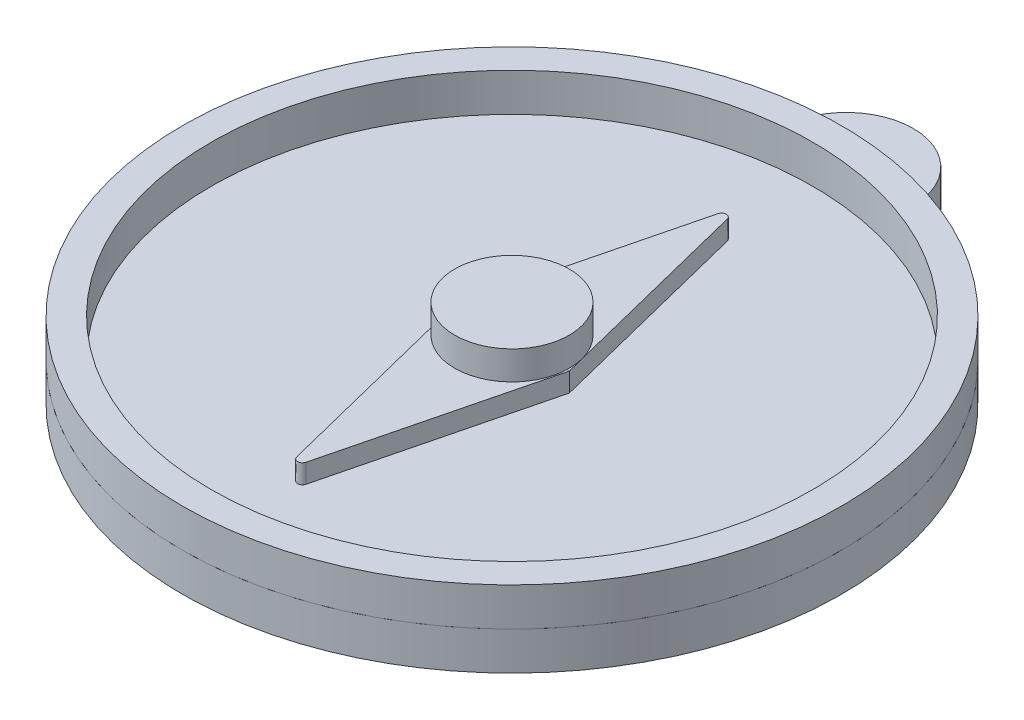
ISO-10303-21;
HEADER;
FILE_DESCRIPTION(('STEP AP214'),'2;1');
FILE_NAME('part.step','',(''),(''),'','','');
FILE_SCHEMA(('AUTOMOTIVE_DESIGN { 1 0 10303 214 1 1 1 1 }'));
ENDSEC;
DATA;
#1=APPLICATION_CONTEXT('core data for automotive mechanical design processes');
#2=APPLICATION_PROTOCOL_DEFINITION('international standard','automotive_design',2000,#1);
#3=PRODUCT_CONTEXT('',#1,'mechanical');
#4=PRODUCT('Part','Part','',(#3));
#5=PRODUCT_RELATED_PRODUCT_CATEGORY('part','',(#4));
#6=PRODUCT_DEFINITION_FORMATION('','',#4);
#7=PRODUCT_DEFINITION_CONTEXT('part definition',#1,'design');
#8=PRODUCT_DEFINITION('design','',#6,#7);
#9=PRODUCT_DEFINITION_SHAPE('','',#8);
#10=(LENGTH_UNIT() NAMED_UNIT(*) SI_UNIT(.MILLI.,.METRE.));
#11=(NAMED_UNIT(*) PLANE_ANGLE_UNIT() SI_UNIT($,.RADIAN.));
#12=(NAMED_UNIT(*) SI_UNIT($,.STERADIAN.) SOLID_ANGLE_UNIT());
#13=UNCERTAINTY_MEASURE_WITH_UNIT(LENGTH_MEASURE(1.E-05),#10,'distance_accuracy_value','');
#14=(GEOMETRIC_REPRESENTATION_CONTEXT(3) GLOBAL_UNCERTAINTY_ASSIGNED_CONTEXT((#13)) GLOBAL_UNIT_ASSIGNED_CONTEXT((#10,
#11,#12)) REPRESENTATION_CONTEXT('',''));
#15=CARTESIAN_POINT('',(0.,0.,0.));
#16=DIRECTION('',(0.,0.,1.));
#17=DIRECTION('',(1.,0.,0.));
#18=AXIS2_PLACEMENT_3D('',#15,#16,#17);
#19=CARTESIAN_POINT('',(0.,4.,-35.));
#20=DIRECTION('',(0.,-1.,0.));
#21=DIRECTION('',(0.,0.,-1.));
#22=AXIS2_PLACEMENT_3D('',#19,#20,#21);
#23=CYLINDRICAL_SURFACE('',#22,7.);
#24=CARTESIAN_POINT('',(0.,0.,-35.));
#25=DIRECTION('',(0.,1.,0.));
#26=DIRECTION('',(0.,0.,1.));
#27=AXIS2_PLACEMENT_3D('',#24,#25,#26);
#28=CIRCLE('',#27,7.);
#29=CARTESIAN_POINT('',(6.89699635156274,0.,-33.8035714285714));
#30=VERTEX_POINT('',#29);
#31=CARTESIAN_POINT('',(-6.8969963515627,0.,-33.8035714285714));
#32=VERTEX_POINT('',#31);
#33=EDGE_CURVE('E79',#30,#32,#28,.T.);
#34=ORIENTED_EDGE('',*,*,#33,.T.);
#35=DIRECTION('',(0.,-1.,0.));
#36=VECTOR('',#35,1.);
#37=CARTESIAN_POINT('',(-6.8969963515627,4.,-33.8035714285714));
#38=LINE('',#37,#36);
#39=CARTESIAN_POINT('',(-6.8969963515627,4.,-33.8035714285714));
#40=VERTEX_POINT('',#39);
#41=EDGE_CURVE('E12',#40,#32,#38,.T.);
#42=ORIENTED_EDGE('',*,*,#41,.F.);
#43=CARTESIAN_POINT('',(0.,4.,-35.));
#44=DIRECTION('',(0.,1.,0.));
#45=DIRECTION('',(0.,0.,1.));
#46=AXIS2_PLACEMENT_3D('',#43,#44,#45);
#47=CIRCLE('',#46,7.);
#48=CARTESIAN_POINT('',(6.89699635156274,4.,-33.8035714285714));
#49=VERTEX_POINT('',#48);
#50=EDGE_CURVE('E78',#49,#40,#47,.T.);
#51=ORIENTED_EDGE('',*,*,#50,.F.);
#52=DIRECTION('',(0.,-1.,0.));
#53=VECTOR('',#52,1.);
#54=CARTESIAN_POINT('',(6.89699635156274,4.,-33.8035714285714));
#55=LINE('',#54,#53);
#56=EDGE_CURVE('E56',#49,#30,#55,.T.);
#57=ORIENTED_EDGE('',*,*,#56,.T.);
#58=EDGE_LOOP('',(#34,#42,#51,#57));
#59=FACE_BOUND('',#58,.T.);
#60=ADVANCED_FACE('F48',(#59),#23,.T.);
#61=CARTESIAN_POINT('',(0.,4.,0.));
#62=DIRECTION('',(0.,-1.,0.));
#63=DIRECTION('',(0.,0.,-1.));
#64=AXIS2_PLACEMENT_3D('',#61,#62,#63);
#65=CYLINDRICAL_SURFACE('',#64,34.5);
#66=CARTESIAN_POINT('',(0.,0.,0.));
#67=DIRECTION('',(0.,1.,0.));
#68=DIRECTION('',(0.,0.,1.));
#69=AXIS2_PLACEMENT_3D('',#66,#67,#68);
#70=CIRCLE('',#69,34.5);
#71=EDGE_CURVE('E71',#32,#30,#70,.T.);
#72=ORIENTED_EDGE('',*,*,#71,.T.);
#73=ORIENTED_EDGE('',*,*,#56,.F.);
#74=CARTESIAN_POINT('',(0.,4.,0.));
#75=DIRECTION('',(0.,1.,0.));
#76=DIRECTION('',(0.,0.,1.));
#77=AXIS2_PLACEMENT_3D('',#74,#75,#76);
#78=CIRCLE('',#77,34.5);
#79=EDGE_CURVE('E63',#40,#49,#78,.T.);
#80=ORIENTED_EDGE('',*,*,#79,.F.);
#81=ORIENTED_EDGE('',*,*,#41,.T.);
#82=EDGE_LOOP('',(#72,#73,#80,#81));
#83=FACE_BOUND('',#82,.T.);
#84=ADVANCED_FACE('F74',(#83),#65,.T.);
#85=CARTESIAN_POINT('',(0.,4.,-17.5));
#86=DIRECTION('',(0.,1.,0.));
#87=DIRECTION('',(0.,0.,1.));
#88=AXIS2_PLACEMENT_3D('',#85,#86,#87);
#89=PLANE('',#88);
#90=CARTESIAN_POINT('',(0.,4.,0.));
#91=DIRECTION('',(0.,1.,0.));
#92=DIRECTION('',(0.,0.,1.));
#93=AXIS2_PLACEMENT_3D('',#90,#91,#92);
#94=CIRCLE('',#93,1.625);
#95=CARTESIAN_POINT('',(0.,4.,1.625));
#96=VERTEX_POINT('',#95);
#97=EDGE_CURVE('E86',#96,#96,#94,.T.);
#98=ORIENTED_EDGE('',*,*,#97,.F.);
#99=EDGE_LOOP('',(#98));
#100=FACE_BOUND('',#99,.T.);
#101=ORIENTED_EDGE('',*,*,#50,.T.);
#102=ORIENTED_EDGE('',*,*,#79,.T.);
#103=EDGE_LOOP('',(#101,#102));
#104=FACE_BOUND('',#103,.T.);
#105=ADVANCED_FACE('F121',(#100,#104),#89,.T.);
#106=CARTESIAN_POINT('',(0.,0.,-17.5));
#107=DIRECTION('',(0.,1.,0.));
#108=DIRECTION('',(0.,0.,1.));
#109=AXIS2_PLACEMENT_3D('',#106,#107,#108);
#110=PLANE('',#109);
#111=ORIENTED_EDGE('',*,*,#33,.F.);
#112=ORIENTED_EDGE('',*,*,#71,.F.);
#113=EDGE_LOOP('',(#111,#112));
#114=FACE_BOUND('',#113,.T.);
#115=ADVANCED_FACE('F82',(#114),#110,.F.);
#116=CARTESIAN_POINT('',(0.,6.25,0.));
#117=DIRECTION('',(0.,-1.,0.));
#118=DIRECTION('',(0.,0.,-1.));
#119=AXIS2_PLACEMENT_3D('',#116,#117,#118);
#120=CYLINDRICAL_SURFACE('',#119,1.625);
#121=CARTESIAN_POINT('',(0.,6.25,0.));
#122=DIRECTION('',(0.,1.,0.));
#123=DIRECTION('',(0.,0.,1.));
#124=AXIS2_PLACEMENT_3D('',#121,#122,#123);
#125=CIRCLE('',#124,1.625);
#126=CARTESIAN_POINT('',(0.,6.25,1.625));
#127=VERTEX_POINT('',#126);
#128=EDGE_CURVE('E83',#127,#127,#125,.T.);
#129=ORIENTED_EDGE('',*,*,#128,.F.);
#130=EDGE_LOOP('',(#129));
#131=FACE_BOUND('',#130,.T.);
#132=ORIENTED_EDGE('',*,*,#97,.T.);
#133=EDGE_LOOP('',(#132));
#134=FACE_BOUND('',#133,.T.);
#135=ADVANCED_FACE('F105',(#131,#134),#120,.T.);
#136=CARTESIAN_POINT('',(0.,9.25,0.));
#137=DIRECTION('',(0.,-1.,0.));
#138=DIRECTION('',(0.,0.,-1.));
#139=AXIS2_PLACEMENT_3D('',#136,#137,#138);
#140=CYLINDRICAL_SURFACE('',#139,6.);
#141=CARTESIAN_POINT('',(0.,9.25,0.));
#142=DIRECTION('',(0.,1.,0.));
#143=DIRECTION('',(0.,0.,1.));
#144=AXIS2_PLACEMENT_3D('',#141,#142,#143);
#145=CIRCLE('',#144,6.);
#146=CARTESIAN_POINT('',(0.,9.25,6.));
#147=VERTEX_POINT('',#146);
#148=EDGE_CURVE('E92',#147,#147,#145,.T.);
#149=ORIENTED_EDGE('',*,*,#148,.F.);
#150=EDGE_LOOP('',(#149));
#151=FACE_BOUND('',#150,.T.);
#152=CARTESIAN_POINT('',(0.,6.25,0.));
#153=DIRECTION('',(0.,1.,0.));
#154=DIRECTION('',(0.,0.,1.));
#155=AXIS2_PLACEMENT_3D('',#152,#153,#154);
#156=CIRCLE('',#155,6.);
#157=CARTESIAN_POINT('',(0.,6.25,6.));
#158=VERTEX_POINT('',#157);
#159=EDGE_CURVE('E94',#158,#158,#156,.T.);
#160=ORIENTED_EDGE('',*,*,#159,.T.);
#161=EDGE_LOOP('',(#160));
#162=FACE_BOUND('',#161,.T.);
#163=ADVANCED_FACE('F102',(#151,#162),#140,.T.);
#164=CARTESIAN_POINT('',(0.,9.25,0.));
#165=DIRECTION('',(0.,1.,0.));
#166=DIRECTION('',(0.,0.,1.));
#167=AXIS2_PLACEMENT_3D('',#164,#165,#166);
#168=PLANE('',#167);
#169=ORIENTED_EDGE('',*,*,#148,.T.);
#170=EDGE_LOOP('',(#169));
#171=FACE_BOUND('',#170,.T.);
#172=ADVANCED_FACE('F100',(#171),#168,.T.);
#173=CARTESIAN_POINT('',(0.,6.25,0.));
#174=DIRECTION('',(0.,1.,0.));
#175=DIRECTION('',(0.,0.,1.));
#176=AXIS2_PLACEMENT_3D('',#173,#174,#175);
#177=PLANE('',#176);
#178=ORIENTED_EDGE('',*,*,#128,.T.);
#179=EDGE_LOOP('',(#178));
#180=FACE_BOUND('',#179,.T.);
#181=ORIENTED_EDGE('',*,*,#159,.F.);
#182=EDGE_LOOP('',(#181));
#183=FACE_BOUND('',#182,.T.);
#184=ADVANCED_FACE('F109',(#180,#183),#177,.F.);
#185=CLOSED_SHELL('',(#60,#84,#105,#115,#135,#163,#172,#184));
#186=MANIFOLD_SOLID_BREP('B2',#185);
#187=CARTESIAN_POINT('',(0.,6.,0.));
#188=DIRECTION('',(0.,1.,0.));
#189=DIRECTION('',(0.,0.,1.));
#190=AXIS2_PLACEMENT_3D('',#187,#188,#189);
#191=PLANE('',#190);
#192=DIRECTION('',(0.242535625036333,0.,-0.970142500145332));
#193=VECTOR('',#192,1.);
#194=CARTESIAN_POINT('',(0.,6.,24.));
#195=LINE('',#194,#193);
#196=CARTESIAN_POINT('',(0.485071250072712,6.,22.0597149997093));
#197=VERTEX_POINT('',#196);
#198=CARTESIAN_POINT('',(6.00000000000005,6.,0.));
#199=VERTEX_POINT('',#198);
#200=EDGE_CURVE('E275',#197,#199,#195,.T.);
#201=ORIENTED_EDGE('',*,*,#200,.T.);
#202=DIRECTION('',(-1.,0.,0.));
#203=VECTOR('',#202,1.);
#204=CARTESIAN_POINT('',(0.,6.,0.));
#205=LINE('',#204,#203);
#206=CARTESIAN_POINT('',(2.,6.,0.));
#207=VERTEX_POINT('',#206);
#208=EDGE_CURVE('E46',#199,#207,#205,.T.);
#209=ORIENTED_EDGE('',*,*,#208,.T.);
#210=CARTESIAN_POINT('',(0.,6.,0.));
#211=DIRECTION('',(0.,1.,0.));
#212=DIRECTION('',(0.,0.,1.));
#213=AXIS2_PLACEMENT_3D('',#210,#211,#212);
#214=CIRCLE('',#213,2.);
#215=CARTESIAN_POINT('',(-2.,6.,0.));
#216=VERTEX_POINT('',#215);
#217=EDGE_CURVE('E246',#216,#207,#214,.T.);
#218=ORIENTED_EDGE('',*,*,#217,.F.);
#219=CARTESIAN_POINT('',(-5.99999999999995,6.,0.));
#220=VERTEX_POINT('',#219);
#221=EDGE_CURVE('E191',#216,#220,#205,.T.);
#222=ORIENTED_EDGE('',*,*,#221,.T.);
#223=DIRECTION('',(0.242535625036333,0.,0.970142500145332));
#224=VECTOR('',#223,1.);
#225=CARTESIAN_POINT('',(-5.99999999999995,6.,0.));
#226=LINE('',#225,#224);
#227=CARTESIAN_POINT('',(-0.485071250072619,6.,22.0597149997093));
#228=VERTEX_POINT('',#227);
#229=EDGE_CURVE('E244',#220,#228,#226,.T.);
#230=ORIENTED_EDGE('',*,*,#229,.T.);
#231=CARTESIAN_POINT('',(0.,6.,21.9384471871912));
#232=DIRECTION('',(0.,1.,0.));
#233=DIRECTION('',(0.,0.,1.));
#234=AXIS2_PLACEMENT_3D('',#231,#232,#233);
#235=CIRCLE('',#234,0.5);
#236=EDGE_CURVE('E298',#228,#197,#235,.T.);
#237=ORIENTED_EDGE('',*,*,#236,.T.);
#238=EDGE_LOOP('',(#201,#209,#218,#222,#230,#237));
#239=FACE_BOUND('',#238,.T.);
#240=ADVANCED_FACE('F187',(#239),#191,.T.);
#241=ORIENTED_EDGE('',*,*,#208,.F.);
#242=DIRECTION('',(-0.242535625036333,0.,-0.970142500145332));
#243=VECTOR('',#242,1.);
#244=CARTESIAN_POINT('',(6.00000000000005,6.,0.));
#245=LINE('',#244,#243);
#246=CARTESIAN_POINT('',(0.485071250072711,6.,-22.0597149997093));
#247=VERTEX_POINT('',#246);
#248=EDGE_CURVE('E260',#199,#247,#245,.T.);
#249=ORIENTED_EDGE('',*,*,#248,.T.);
#250=CARTESIAN_POINT('',(0.,6.,-21.9384471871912));
#251=DIRECTION('',(0.,1.,0.));
#252=DIRECTION('',(0.,0.,1.));
#253=AXIS2_PLACEMENT_3D('',#250,#251,#252);
#254=CIRCLE('',#253,0.5);
#255=CARTESIAN_POINT('',(-0.485071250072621,6.,-22.0597149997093));
#256=VERTEX_POINT('',#255);
#257=EDGE_CURVE('E256',#247,#256,#254,.T.);
#258=ORIENTED_EDGE('',*,*,#257,.T.);
#259=DIRECTION('',(-0.242535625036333,0.,0.970142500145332));
#260=VECTOR('',#259,1.);
#261=CARTESIAN_POINT('',(0.,6.,-24.));
#262=LINE('',#261,#260);
#263=EDGE_CURVE('E251',#256,#220,#262,.T.);
#264=ORIENTED_EDGE('',*,*,#263,.T.);
#265=ORIENTED_EDGE('',*,*,#221,.F.);
#266=EDGE_CURVE('E283',#207,#216,#214,.T.);
#267=ORIENTED_EDGE('',*,*,#266,.F.);
#268=EDGE_LOOP('',(#241,#249,#258,#264,#265,#267));
#269=FACE_BOUND('',#268,.T.);
#270=ADVANCED_FACE('F253',(#269),#191,.T.);
#271=CARTESIAN_POINT('',(0.,4.,0.));
#272=DIRECTION('',(0.,1.,0.));
#273=DIRECTION('',(0.,0.,1.));
#274=AXIS2_PLACEMENT_3D('',#271,#272,#273);
#275=PLANE('',#274);
#276=DIRECTION('',(-0.242535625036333,0.,0.970142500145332));
#277=VECTOR('',#276,1.);
#278=CARTESIAN_POINT('',(0.,4.,-24.));
#279=LINE('',#278,#277);
#280=CARTESIAN_POINT('',(-0.485071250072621,4.,-22.0597149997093));
#281=VERTEX_POINT('',#280);
#282=CARTESIAN_POINT('',(-5.99999999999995,4.,0.));
#283=VERTEX_POINT('',#282);
#284=EDGE_CURVE('E266',#281,#283,#279,.T.);
#285=ORIENTED_EDGE('',*,*,#284,.F.);
#286=CARTESIAN_POINT('',(0.,4.,-21.9384471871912));
#287=DIRECTION('',(0.,1.,0.));
#288=DIRECTION('',(0.,0.,1.));
#289=AXIS2_PLACEMENT_3D('',#286,#287,#288);
#290=CIRCLE('',#289,0.5);
#291=CARTESIAN_POINT('',(0.485071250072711,4.,-22.0597149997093));
#292=VERTEX_POINT('',#291);
#293=EDGE_CURVE('E294',#281,#292,#290,.F.);
#294=ORIENTED_EDGE('',*,*,#293,.T.);
#295=DIRECTION('',(-0.242535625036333,0.,-0.970142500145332));
#296=VECTOR('',#295,1.);
#297=CARTESIAN_POINT('',(6.00000000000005,4.,0.));
#298=LINE('',#297,#296);
#299=CARTESIAN_POINT('',(6.00000000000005,4.,0.));
#300=VERTEX_POINT('',#299);
#301=EDGE_CURVE('E280',#300,#292,#298,.T.);
#302=ORIENTED_EDGE('',*,*,#301,.F.);
#303=DIRECTION('',(0.242535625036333,0.,-0.970142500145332));
#304=VECTOR('',#303,1.);
#305=CARTESIAN_POINT('',(0.,4.,24.));
#306=LINE('',#305,#304);
#307=CARTESIAN_POINT('',(0.485071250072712,4.,22.0597149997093));
#308=VERTEX_POINT('',#307);
#309=EDGE_CURVE('E287',#308,#300,#306,.T.);
#310=ORIENTED_EDGE('',*,*,#309,.F.);
#311=CARTESIAN_POINT('',(0.,4.,21.9384471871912));
#312=DIRECTION('',(0.,1.,0.));
#313=DIRECTION('',(0.,0.,1.));
#314=AXIS2_PLACEMENT_3D('',#311,#312,#313);
#315=CIRCLE('',#314,0.5);
#316=CARTESIAN_POINT('',(-0.485071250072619,4.,22.0597149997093));
#317=VERTEX_POINT('',#316);
#318=EDGE_CURVE('E292',#308,#317,#315,.F.);
#319=ORIENTED_EDGE('',*,*,#318,.T.);
#320=DIRECTION('',(0.242535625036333,0.,0.970142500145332));
#321=VECTOR('',#320,1.);
#322=CARTESIAN_POINT('',(-5.99999999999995,4.,0.));
#323=LINE('',#322,#321);
#324=EDGE_CURVE('E285',#283,#317,#323,.T.);
#325=ORIENTED_EDGE('',*,*,#324,.F.);
#326=EDGE_LOOP('',(#285,#294,#302,#310,#319,#325));
#327=FACE_BOUND('',#326,.T.);
#328=CARTESIAN_POINT('',(0.,4.,0.));
#329=DIRECTION('',(0.,1.,0.));
#330=DIRECTION('',(0.,0.,1.));
#331=AXIS2_PLACEMENT_3D('',#328,#329,#330);
#332=CIRCLE('',#331,2.);
#333=CARTESIAN_POINT('',(0.,4.,2.));
#334=VERTEX_POINT('',#333);
#335=EDGE_CURVE('E321',#334,#334,#332,.T.);
#336=ORIENTED_EDGE('',*,*,#335,.T.);
#337=EDGE_LOOP('',(#336));
#338=FACE_BOUND('',#337,.T.);
#339=ADVANCED_FACE('F312',(#327,#338),#275,.F.);
#340=CARTESIAN_POINT('',(6.00000000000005,6.,0.));
#341=DIRECTION('',(-0.970142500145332,0.,0.242535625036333));
#342=DIRECTION('',(0.242535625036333,0.,0.970142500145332));
#343=AXIS2_PLACEMENT_3D('',#340,#341,#342);
#344=PLANE('',#343);
#345=ORIENTED_EDGE('',*,*,#301,.T.);
#346=DIRECTION('',(0.,-1.,0.));
#347=VECTOR('',#346,1.);
#348=CARTESIAN_POINT('',(0.485071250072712,6.,-22.0597149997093));
#349=LINE('',#348,#347);
#350=EDGE_CURVE('E296',#292,#247,#349,.F.);
#351=ORIENTED_EDGE('',*,*,#350,.T.);
#352=ORIENTED_EDGE('',*,*,#248,.F.);
#353=DIRECTION('',(0.,-1.,0.));
#354=VECTOR('',#353,1.);
#355=CARTESIAN_POINT('',(6.00000000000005,6.,0.));
#356=LINE('',#355,#354);
#357=EDGE_CURVE('E271',#199,#300,#356,.T.);
#358=ORIENTED_EDGE('',*,*,#357,.T.);
#359=EDGE_LOOP('',(#345,#351,#352,#358));
#360=FACE_BOUND('',#359,.T.);
#361=ADVANCED_FACE('F316',(#360),#344,.F.);
#362=CARTESIAN_POINT('',(0.,6.,-24.));
#363=DIRECTION('',(0.970142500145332,0.,0.242535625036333));
#364=DIRECTION('',(0.242535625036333,0.,-0.970142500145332));
#365=AXIS2_PLACEMENT_3D('',#362,#363,#364);
#366=PLANE('',#365);
#367=ORIENTED_EDGE('',*,*,#263,.F.);
#368=DIRECTION('',(0.,-1.,0.));
#369=VECTOR('',#368,1.);
#370=CARTESIAN_POINT('',(-0.485071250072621,6.,-22.0597149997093));
#371=LINE('',#370,#369);
#372=EDGE_CURVE('E270',#256,#281,#371,.T.);
#373=ORIENTED_EDGE('',*,*,#372,.T.);
#374=ORIENTED_EDGE('',*,*,#284,.T.);
#375=DIRECTION('',(0.,-1.,0.));
#376=VECTOR('',#375,1.);
#377=CARTESIAN_POINT('',(-5.99999999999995,6.,0.));
#378=LINE('',#377,#376);
#379=EDGE_CURVE('E263',#220,#283,#378,.T.);
#380=ORIENTED_EDGE('',*,*,#379,.F.);
#381=EDGE_LOOP('',(#367,#373,#374,#380));
#382=FACE_BOUND('',#381,.T.);
#383=ADVANCED_FACE('F264',(#382),#366,.F.);
#384=CARTESIAN_POINT('',(-5.99999999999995,6.,0.));
#385=DIRECTION('',(0.970142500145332,0.,-0.242535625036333));
#386=DIRECTION('',(-0.242535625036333,0.,-0.970142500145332));
#387=AXIS2_PLACEMENT_3D('',#384,#385,#386);
#388=PLANE('',#387);
#389=ORIENTED_EDGE('',*,*,#324,.T.);
#390=DIRECTION('',(0.,-1.,0.));
#391=VECTOR('',#390,1.);
#392=CARTESIAN_POINT('',(-0.485071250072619,6.,22.0597149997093));
#393=LINE('',#392,#391);
#394=EDGE_CURVE('E249',#317,#228,#393,.F.);
#395=ORIENTED_EDGE('',*,*,#394,.T.);
#396=ORIENTED_EDGE('',*,*,#229,.F.);
#397=ORIENTED_EDGE('',*,*,#379,.T.);
#398=EDGE_LOOP('',(#389,#395,#396,#397));
#399=FACE_BOUND('',#398,.T.);
#400=ADVANCED_FACE('F273',(#399),#388,.F.);
#401=CARTESIAN_POINT('',(0.,6.,24.));
#402=DIRECTION('',(-0.970142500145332,0.,-0.242535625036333));
#403=DIRECTION('',(-0.242535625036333,0.,0.970142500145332));
#404=AXIS2_PLACEMENT_3D('',#401,#402,#403);
#405=PLANE('',#404);
#406=ORIENTED_EDGE('',*,*,#200,.F.);
#407=DIRECTION('',(0.,-1.,0.));
#408=VECTOR('',#407,1.);
#409=CARTESIAN_POINT('',(0.485071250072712,6.,22.0597149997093));
#410=LINE('',#409,#408);
#411=EDGE_CURVE('E301',#197,#308,#410,.T.);
#412=ORIENTED_EDGE('',*,*,#411,.T.);
#413=ORIENTED_EDGE('',*,*,#309,.T.);
#414=ORIENTED_EDGE('',*,*,#357,.F.);
#415=EDGE_LOOP('',(#406,#412,#413,#414));
#416=FACE_BOUND('',#415,.T.);
#417=ADVANCED_FACE('F307',(#416),#405,.F.);
#418=CARTESIAN_POINT('',(0.,6.,0.));
#419=DIRECTION('',(0.,-1.,0.));
#420=DIRECTION('',(0.,0.,-1.));
#421=AXIS2_PLACEMENT_3D('',#418,#419,#420);
#422=CYLINDRICAL_SURFACE('',#421,2.);
#423=ORIENTED_EDGE('',*,*,#266,.T.);
#424=ORIENTED_EDGE('',*,*,#217,.T.);
#425=EDGE_LOOP('',(#423,#424));
#426=FACE_BOUND('',#425,.T.);
#427=ORIENTED_EDGE('',*,*,#335,.F.);
#428=EDGE_LOOP('',(#427));
#429=FACE_BOUND('',#428,.T.);
#430=ADVANCED_FACE('F325',(#426,#429),#422,.F.);
#431=CARTESIAN_POINT('',(0.,6.,-21.9384471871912));
#432=DIRECTION('',(0.,-1.,0.));
#433=DIRECTION('',(0.,0.,-1.));
#434=AXIS2_PLACEMENT_3D('',#431,#432,#433);
#435=CYLINDRICAL_SURFACE('',#434,0.5);
#436=ORIENTED_EDGE('',*,*,#257,.F.);
#437=ORIENTED_EDGE('',*,*,#350,.F.);
#438=ORIENTED_EDGE('',*,*,#293,.F.);
#439=ORIENTED_EDGE('',*,*,#372,.F.);
#440=EDGE_LOOP('',(#436,#437,#438,#439));
#441=FACE_BOUND('',#440,.T.);
#442=ADVANCED_FACE('F319',(#441),#435,.T.);
#443=CARTESIAN_POINT('',(0.,6.,21.9384471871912));
#444=DIRECTION('',(0.,-1.,0.));
#445=DIRECTION('',(0.,0.,-1.));
#446=AXIS2_PLACEMENT_3D('',#443,#444,#445);
#447=CYLINDRICAL_SURFACE('',#446,0.5);
#448=ORIENTED_EDGE('',*,*,#236,.F.);
#449=ORIENTED_EDGE('',*,*,#394,.F.);
#450=ORIENTED_EDGE('',*,*,#318,.F.);
#451=ORIENTED_EDGE('',*,*,#411,.F.);
#452=EDGE_LOOP('',(#448,#449,#450,#451));
#453=FACE_BOUND('',#452,.T.);
#454=ADVANCED_FACE('F189',(#453),#447,.T.);
#455=CLOSED_SHELL('',(#240,#270,#339,#361,#383,#400,#417,#430,#442,#454));
#456=MANIFOLD_SOLID_BREP('B6',#455);
#457=CARTESIAN_POINT('',(0.,8.,0.));
#458=DIRECTION('',(0.,1.,0.));
#459=DIRECTION('',(0.,0.,1.));
#460=AXIS2_PLACEMENT_3D('',#457,#458,#459);
#461=PLANE('',#460);
#462=CARTESIAN_POINT('',(0.,8.,0.));
#463=DIRECTION('',(0.,1.,0.));
#464=DIRECTION('',(0.,0.,1.));
#465=AXIS2_PLACEMENT_3D('',#462,#463,#464);
#466=CIRCLE('',#465,34.5);
#467=CARTESIAN_POINT('',(0.,8.,34.5));
#468=VERTEX_POINT('',#467);
#469=EDGE_CURVE('E186',#468,#468,#466,.T.);
#470=ORIENTED_EDGE('',*,*,#469,.T.);
#471=EDGE_LOOP('',(#470));
#472=FACE_BOUND('',#471,.T.);
#473=CARTESIAN_POINT('',(0.,8.,0.));
#474=DIRECTION('',(0.,1.,0.));
#475=DIRECTION('',(0.,0.,1.));
#476=AXIS2_PLACEMENT_3D('',#473,#474,#475);
#477=CIRCLE('',#476,31.5);
#478=CARTESIAN_POINT('',(0.,8.,31.5));
#479=VERTEX_POINT('',#478);
#480=EDGE_CURVE('E455',#479,#479,#477,.T.);
#481=ORIENTED_EDGE('',*,*,#480,.F.);
#482=EDGE_LOOP('',(#481));
#483=FACE_BOUND('',#482,.T.);
#484=ADVANCED_FACE('F444',(#472,#483),#461,.T.);
#485=CARTESIAN_POINT('',(0.,4.,0.));
#486=DIRECTION('',(0.,1.,0.));
#487=DIRECTION('',(0.,0.,1.));
#488=AXIS2_PLACEMENT_3D('',#485,#486,#487);
#489=PLANE('',#488);
#490=CARTESIAN_POINT('',(0.,4.,0.));
#491=DIRECTION('',(0.,1.,0.));
#492=DIRECTION('',(0.,0.,1.));
#493=AXIS2_PLACEMENT_3D('',#490,#491,#492);
#494=CIRCLE('',#493,34.5);
#495=CARTESIAN_POINT('',(0.,4.,34.5));
#496=VERTEX_POINT('',#495);
#497=EDGE_CURVE('E448',#496,#496,#494,.T.);
#498=ORIENTED_EDGE('',*,*,#497,.F.);
#499=EDGE_LOOP('',(#498));
#500=FACE_BOUND('',#499,.T.);
#501=CARTESIAN_POINT('',(0.,4.,0.));
#502=DIRECTION('',(0.,1.,0.));
#503=DIRECTION('',(0.,0.,1.));
#504=AXIS2_PLACEMENT_3D('',#501,#502,#503);
#505=CIRCLE('',#504,31.5);
#506=CARTESIAN_POINT('',(0.,4.,31.5));
#507=VERTEX_POINT('',#506);
#508=EDGE_CURVE('E457',#507,#507,#505,.T.);
#509=ORIENTED_EDGE('',*,*,#508,.T.);
#510=EDGE_LOOP('',(#509));
#511=FACE_BOUND('',#510,.T.);
#512=ADVANCED_FACE('F467',(#500,#511),#489,.F.);
#513=CARTESIAN_POINT('',(0.,8.,0.));
#514=DIRECTION('',(0.,-1.,0.));
#515=DIRECTION('',(0.,0.,-1.));
#516=AXIS2_PLACEMENT_3D('',#513,#514,#515);
#517=CYLINDRICAL_SURFACE('',#516,34.5);
#518=ORIENTED_EDGE('',*,*,#469,.F.);
#519=EDGE_LOOP('',(#518));
#520=FACE_BOUND('',#519,.T.);
#521=ORIENTED_EDGE('',*,*,#497,.T.);
#522=EDGE_LOOP('',(#521));
#523=FACE_BOUND('',#522,.T.);
#524=ADVANCED_FACE('F446',(#520,#523),#517,.T.);
#525=CARTESIAN_POINT('',(0.,8.,0.));
#526=DIRECTION('',(0.,-1.,0.));
#527=DIRECTION('',(0.,0.,-1.));
#528=AXIS2_PLACEMENT_3D('',#525,#526,#527);
#529=CYLINDRICAL_SURFACE('',#528,31.5);
#530=ORIENTED_EDGE('',*,*,#480,.T.);
#531=EDGE_LOOP('',(#530));
#532=FACE_BOUND('',#531,.T.);
#533=ORIENTED_EDGE('',*,*,#508,.F.);
#534=EDGE_LOOP('',(#533));
#535=FACE_BOUND('',#534,.T.);
#536=ADVANCED_FACE('F463',(#532,#535),#529,.F.);
#537=CLOSED_SHELL('',(#484,#512,#524,#536));
#538=MANIFOLD_SOLID_BREP('B40',#537);
#539=ADVANCED_BREP_SHAPE_REPRESENTATION('',(#18,#186,#456,#538),#14);
#540=SHAPE_DEFINITION_REPRESENTATION(#9,#539);
ENDSEC;
END-ISO-10303-21;
